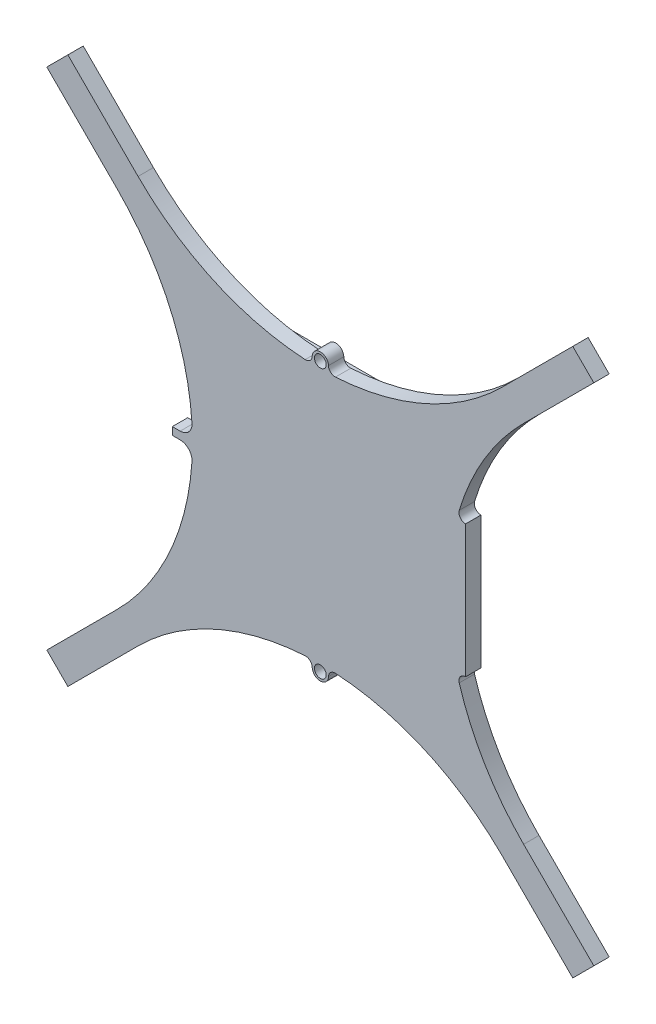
from build123d import *

# Parameters (mm, degrees)
SKETCH1_R           = 0.634780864
BOSS_EXTRUDE1_DEPTH = 1.65
FILLET1_R           = 0.7112
FILLET2_R           = 0.7112
FILLET3_R           = 1.27
SKETCH2_W           = 23
SKETCH2_H           = 2.314
SKETCH2_R           = 0.33
BOSS_EXTRUDE2_DEPTH = 2.6


with BuildPart() as part:
    # Sketch1 → Boss-Extrude1 (new body)
    with BuildSketch(Plane.XY):
        with BuildLine():
            Line((-27.135222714, 29.397964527), (-29.397964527, 27.135222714))
            Line((-29.397964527, 27.135222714), (-21.855060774, 19.592318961))
            ThreePointArc((-21.855060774, 19.592318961), (-15.928204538, 10.7930358), (-13.742710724, 0.41138729))
            Line((-13.742710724, 0.41138729), (-15.908512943, 0.41138729))
            Line((-15.908512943, 0.41138729), (-15.908512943, -0.41138729))
            Line((-15.908512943, -0.41138729), (-13.742710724, -0.41138729))
            ThreePointArc((-13.742710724, -0.41138729), (-15.928204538, -10.7930358), (-21.855060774, -19.592318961))
            Line((-21.855060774, -19.592318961), (-29.397964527, -27.135222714))
            Line((-29.397964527, -27.135222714), (-27.135222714, -29.397964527))
            Line((-27.135222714, -29.397964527), (-19.592318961, -21.855060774))
            ThreePointArc((-19.592318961, -21.855060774), (-10.842511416, -15.949186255), (-0.51885361, -13.744514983))
            ThreePointArc((-0.51885361, -13.744514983), (0, -15.324082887), (0.51885361, -13.744514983))
            ThreePointArc((0.51885361, -13.744514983), (10.842511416, -15.949186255), (19.592318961, -21.855060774))
            Line((19.592318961, -21.855060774), (27.135222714, -29.397964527))
            Line((27.135222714, -29.397964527), (29.397964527, -27.135222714))
            Line((29.397964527, -27.135222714), (21.855060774, -19.592318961))
            ThreePointArc((21.855060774, -19.592318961), (17.437236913, -13.828628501), (14.668755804, -7.114999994))
            Line((14.668755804, -7.114999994), (15.618947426, -7.114999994))
            Line((15.618947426, -7.114999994), (15.618947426, 7.114999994))
            Line((15.618947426, 7.114999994), (14.668755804, 7.114999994))
            ThreePointArc((14.668755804, 7.114999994), (17.437236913, 13.828628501), (21.855060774, 19.592318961))
            Line((21.855060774, 19.592318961), (29.397964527, 27.135222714))
            Line((29.397964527, 27.135222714), (27.135222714, 29.397964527))
            Line((27.135222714, 29.397964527), (19.592318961, 21.855060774))
            ThreePointArc((19.592318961, 21.855060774), (10.842511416, 15.949186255), (0.51885361, 13.744514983))
            ThreePointArc((0.51885361, 13.744514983), (0, 15.324082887), (-0.51885361, 13.744514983))
            ThreePointArc((-0.51885361, 13.744514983), (-10.842511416, 15.949186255), (-19.592318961, 21.855060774))
            Line((-19.592318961, 21.855060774), (-27.135222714, 29.397964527))
        make_face()
        with Locations((0, 14.449082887)):
            Circle(SKETCH1_R, mode=Mode.SUBTRACT)
        with Locations(Location((0, -14.449082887, 0), (0, 0, 180))):
            Circle(SKETCH1_R, mode=Mode.SUBTRACT)
    extrude(amount=BOSS_EXTRUDE1_DEPTH)

    # Fillet1
    fillet1_edges = [part.edges().sort_by_distance(p)[0] for p in [
        (0.51885361, 13.744514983, 0.825),
        (0.51885361, -13.744514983, 0.825),
        (-0.51885361, -13.744514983, 0.825),
        (-0.51885361, 13.744514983, 0.825),
    ]]
    fillet(fillet1_edges, radius=FILLET1_R)

    # Fillet2
    fillet2_edges = [part.edges().sort_by_distance(p)[0] for p in [
        (14.668755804, 7.114999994, 0.825),
        (14.668755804, -7.114999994, 0.825),
    ]]
    fillet(fillet2_edges, radius=FILLET2_R)

    # Fillet3
    fillet3_edges = [part.edges().sort_by_distance(p)[0] for p in [
        (-13.742710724, -0.41138729, 0.825),
        (-13.742710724, 0.41138729, 0.825),
    ]]
    fillet(fillet3_edges, radius=FILLET3_R)

    # Sketch2 → Boss-Extrude2 (add)
    # profile 1 of 2: a face of its own
    with BuildSketch(Plane(origin=(0, 0, 0), x_dir=(-1, 0, 0), z_dir=(0, 0, -1))):
        with Locations((0, 10.385)):
            Rectangle(SKETCH2_W, SKETCH2_H)
        with Locations(Location((-8.002, 10.385, 0), (0, 0, 180))):
            Circle(SKETCH2_R, mode=Mode.SUBTRACT)
        with Locations(Location((-6.224, 10.385, 0), (0, 0, 180))):
            Circle(SKETCH2_R, mode=Mode.SUBTRACT)
        with Locations(Location((-4.446, 10.385, 0), (0, 0, 180))):
            Circle(SKETCH2_R, mode=Mode.SUBTRACT)
        with Locations(Location((-2.668, 10.385, 0), (0, 0, 180))):
            Circle(SKETCH2_R, mode=Mode.SUBTRACT)
        with Locations(Location((-0.89, 10.385, 0), (0, 0, 180))):
            Circle(SKETCH2_R, mode=Mode.SUBTRACT)
        with Locations(Location((0.888, 10.385, 0), (0, 0, 180))):
            Circle(SKETCH2_R, mode=Mode.SUBTRACT)
        with Locations(Location((2.666, 10.385, 0), (0, 0, 180))):
            Circle(SKETCH2_R, mode=Mode.SUBTRACT)
        with Locations(Location((4.444, 10.385, 0), (0, 0, 180))):
            Circle(SKETCH2_R, mode=Mode.SUBTRACT)
        with Locations(Location((6.222, 10.385, 0), (0, 0, 180))):
            Circle(SKETCH2_R, mode=Mode.SUBTRACT)
        with Locations(Location((8, 10.385, 0), (0, 0, 180))):
            Circle(SKETCH2_R, mode=Mode.SUBTRACT)
    # profile 2 of 2: a face of its own
    with BuildSketch(Plane(origin=(0, 0, 0), x_dir=(-1, 0, 0), z_dir=(0, 0, -1))):
        with Locations((0, -10.385)):
            Rectangle(SKETCH2_W, SKETCH2_H)
        with Locations((8, -10.385)):
            Circle(SKETCH2_R, mode=Mode.SUBTRACT)
        with Locations((6.222, -10.385)):
            Circle(SKETCH2_R, mode=Mode.SUBTRACT)
        with Locations((4.444, -10.385)):
            Circle(SKETCH2_R, mode=Mode.SUBTRACT)
        with Locations((2.666, -10.385)):
            Circle(SKETCH2_R, mode=Mode.SUBTRACT)
        with Locations((0.888, -10.385)):
            Circle(SKETCH2_R, mode=Mode.SUBTRACT)
        with Locations((-0.89, -10.385)):
            Circle(SKETCH2_R, mode=Mode.SUBTRACT)
        with Locations((-2.668, -10.385)):
            Circle(SKETCH2_R, mode=Mode.SUBTRACT)
        with Locations((-4.446, -10.385)):
            Circle(SKETCH2_R, mode=Mode.SUBTRACT)
        with Locations((-6.224, -10.385)):
            Circle(SKETCH2_R, mode=Mode.SUBTRACT)
        with Locations((-8.002, -10.385)):
            Circle(SKETCH2_R, mode=Mode.SUBTRACT)
    extrude(amount=BOSS_EXTRUDE2_DEPTH)


solid = part.part
